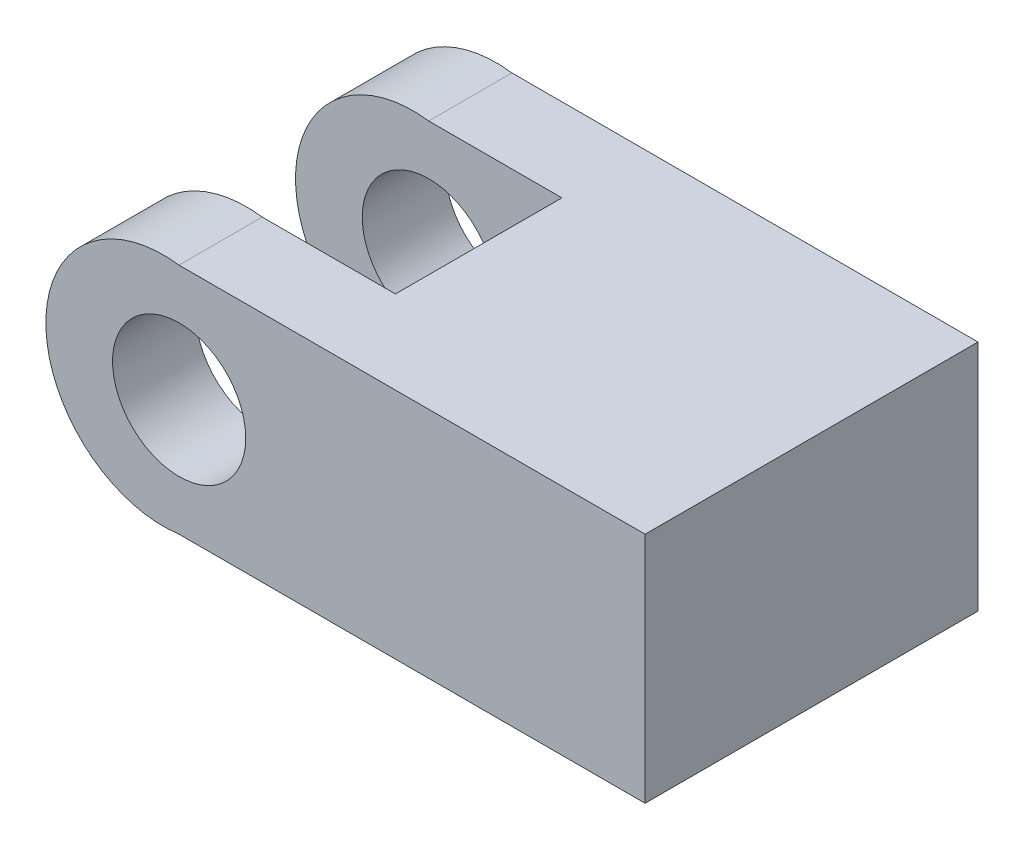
ISO-10303-21;
HEADER;
FILE_DESCRIPTION(('STEP AP214'),'2;1');
FILE_NAME('part.step','',(''),(''),'','','');
FILE_SCHEMA(('AUTOMOTIVE_DESIGN { 1 0 10303 214 1 1 1 1 }'));
ENDSEC;
DATA;
#1=APPLICATION_CONTEXT('core data for automotive mechanical design processes');
#2=APPLICATION_PROTOCOL_DEFINITION('international standard','automotive_design',2000,#1);
#3=PRODUCT_CONTEXT('',#1,'mechanical');
#4=PRODUCT('Part','Part','',(#3));
#5=PRODUCT_RELATED_PRODUCT_CATEGORY('part','',(#4));
#6=PRODUCT_DEFINITION_FORMATION('','',#4);
#7=PRODUCT_DEFINITION_CONTEXT('part definition',#1,'design');
#8=PRODUCT_DEFINITION('design','',#6,#7);
#9=PRODUCT_DEFINITION_SHAPE('','',#8);
#10=(LENGTH_UNIT() NAMED_UNIT(*) SI_UNIT(.MILLI.,.METRE.));
#11=(NAMED_UNIT(*) PLANE_ANGLE_UNIT() SI_UNIT($,.RADIAN.));
#12=(NAMED_UNIT(*) SI_UNIT($,.STERADIAN.) SOLID_ANGLE_UNIT());
#13=UNCERTAINTY_MEASURE_WITH_UNIT(LENGTH_MEASURE(1.E-05),#10,'distance_accuracy_value','');
#14=(GEOMETRIC_REPRESENTATION_CONTEXT(3) GLOBAL_UNCERTAINTY_ASSIGNED_CONTEXT((#13)) GLOBAL_UNIT_ASSIGNED_CONTEXT((#10,
#11,#12)) REPRESENTATION_CONTEXT('',''));
#15=CARTESIAN_POINT('',(0.,0.,0.));
#16=DIRECTION('',(0.,0.,1.));
#17=DIRECTION('',(1.,0.,0.));
#18=AXIS2_PLACEMENT_3D('',#15,#16,#17);
#19=CARTESIAN_POINT('',(0.,7.,0.));
#20=DIRECTION('',(0.,-1.,0.));
#21=DIRECTION('',(0.,0.,-1.));
#22=AXIS2_PLACEMENT_3D('',#19,#20,#21);
#23=PLANE('',#22);
#24=DIRECTION('',(-1.,0.,0.));
#25=VECTOR('',#24,1.);
#26=CARTESIAN_POINT('',(0.,7.,-7.5));
#27=LINE('',#26,#25);
#28=CARTESIAN_POINT('',(0.,7.,-7.5));
#29=VERTEX_POINT('',#28);
#30=CARTESIAN_POINT('',(-4.,7.,-7.5));
#31=VERTEX_POINT('',#30);
#32=EDGE_CURVE('E122',#29,#31,#27,.T.);
#33=ORIENTED_EDGE('',*,*,#32,.F.);
#34=DIRECTION('',(0.,0.,-1.));
#35=VECTOR('',#34,1.);
#36=CARTESIAN_POINT('',(0.,7.,0.));
#37=LINE('',#36,#35);
#38=CARTESIAN_POINT('',(0.,7.,-2.5));
#39=VERTEX_POINT('',#38);
#40=EDGE_CURVE('E125',#39,#29,#37,.T.);
#41=ORIENTED_EDGE('',*,*,#40,.F.);
#42=DIRECTION('',(1.,0.,0.));
#43=VECTOR('',#42,1.);
#44=CARTESIAN_POINT('',(0.,7.,-2.5));
#45=LINE('',#44,#43);
#46=CARTESIAN_POINT('',(-4.,7.,-2.5));
#47=VERTEX_POINT('',#46);
#48=EDGE_CURVE('E107',#47,#39,#45,.T.);
#49=ORIENTED_EDGE('',*,*,#48,.F.);
#50=DIRECTION('',(0.,0.,1.));
#51=VECTOR('',#50,1.);
#52=CARTESIAN_POINT('',(-4.,7.,-10.));
#53=LINE('',#52,#51);
#54=CARTESIAN_POINT('',(-4.,7.,0.));
#55=VERTEX_POINT('',#54);
#56=EDGE_CURVE('E137',#47,#55,#53,.T.);
#57=ORIENTED_EDGE('',*,*,#56,.T.);
#58=DIRECTION('',(1.,0.,0.));
#59=VECTOR('',#58,1.);
#60=CARTESIAN_POINT('',(0.,7.,0.));
#61=LINE('',#60,#59);
#62=CARTESIAN_POINT('',(10.,7.,0.));
#63=VERTEX_POINT('',#62);
#64=EDGE_CURVE('E94',#55,#63,#61,.T.);
#65=ORIENTED_EDGE('',*,*,#64,.T.);
#66=DIRECTION('',(0.,0.,-1.));
#67=VECTOR('',#66,1.);
#68=CARTESIAN_POINT('',(10.,7.,0.));
#69=LINE('',#68,#67);
#70=CARTESIAN_POINT('',(10.,7.,-10.));
#71=VERTEX_POINT('',#70);
#72=EDGE_CURVE('E57',#63,#71,#69,.T.);
#73=ORIENTED_EDGE('',*,*,#72,.T.);
#74=DIRECTION('',(-1.,0.,0.));
#75=VECTOR('',#74,1.);
#76=CARTESIAN_POINT('',(0.,7.,-10.));
#77=LINE('',#76,#75);
#78=CARTESIAN_POINT('',(-4.,7.,-10.));
#79=VERTEX_POINT('',#78);
#80=EDGE_CURVE('E87',#71,#79,#77,.T.);
#81=ORIENTED_EDGE('',*,*,#80,.T.);
#82=EDGE_CURVE('E142',#79,#31,#53,.T.);
#83=ORIENTED_EDGE('',*,*,#82,.T.);
#84=EDGE_LOOP('',(#33,#41,#49,#57,#65,#73,#81,#83));
#85=FACE_BOUND('',#84,.T.);
#86=ADVANCED_FACE('F33',(#85),#23,.F.);
#87=CARTESIAN_POINT('',(0.,0.,0.));
#88=DIRECTION('',(0.,-1.,0.));
#89=DIRECTION('',(0.,0.,-1.));
#90=AXIS2_PLACEMENT_3D('',#87,#88,#89);
#91=PLANE('',#90);
#92=DIRECTION('',(0.,0.,-1.));
#93=VECTOR('',#92,1.);
#94=CARTESIAN_POINT('',(0.,0.,0.));
#95=LINE('',#94,#93);
#96=CARTESIAN_POINT('',(0.,0.,-2.5));
#97=VERTEX_POINT('',#96);
#98=CARTESIAN_POINT('',(0.,0.,-7.5));
#99=VERTEX_POINT('',#98);
#100=EDGE_CURVE('E11',#97,#99,#95,.T.);
#101=ORIENTED_EDGE('',*,*,#100,.T.);
#102=DIRECTION('',(-1.,0.,0.));
#103=VECTOR('',#102,1.);
#104=CARTESIAN_POINT('',(0.,0.,-7.5));
#105=LINE('',#104,#103);
#106=CARTESIAN_POINT('',(-4.,0.,-7.5));
#107=VERTEX_POINT('',#106);
#108=EDGE_CURVE('E111',#99,#107,#105,.T.);
#109=ORIENTED_EDGE('',*,*,#108,.T.);
#110=DIRECTION('',(0.,0.,1.));
#111=VECTOR('',#110,1.);
#112=CARTESIAN_POINT('',(-4.,0.,-10.));
#113=LINE('',#112,#111);
#114=CARTESIAN_POINT('',(-4.,0.,-10.));
#115=VERTEX_POINT('',#114);
#116=EDGE_CURVE('E92',#115,#107,#113,.T.);
#117=ORIENTED_EDGE('',*,*,#116,.F.);
#118=DIRECTION('',(-1.,0.,0.));
#119=VECTOR('',#118,1.);
#120=CARTESIAN_POINT('',(0.,0.,-10.));
#121=LINE('',#120,#119);
#122=CARTESIAN_POINT('',(10.,0.,-10.));
#123=VERTEX_POINT('',#122);
#124=EDGE_CURVE('E79',#123,#115,#121,.T.);
#125=ORIENTED_EDGE('',*,*,#124,.F.);
#126=DIRECTION('',(0.,0.,-1.));
#127=VECTOR('',#126,1.);
#128=CARTESIAN_POINT('',(10.,0.,0.));
#129=LINE('',#128,#127);
#130=CARTESIAN_POINT('',(10.,0.,0.));
#131=VERTEX_POINT('',#130);
#132=EDGE_CURVE('E70',#131,#123,#129,.T.);
#133=ORIENTED_EDGE('',*,*,#132,.F.);
#134=DIRECTION('',(1.,0.,0.));
#135=VECTOR('',#134,1.);
#136=CARTESIAN_POINT('',(0.,0.,0.));
#137=LINE('',#136,#135);
#138=CARTESIAN_POINT('',(-4.,0.,0.));
#139=VERTEX_POINT('',#138);
#140=EDGE_CURVE('E80',#139,#131,#137,.T.);
#141=ORIENTED_EDGE('',*,*,#140,.F.);
#142=CARTESIAN_POINT('',(-4.,0.,-2.5));
#143=VERTEX_POINT('',#142);
#144=EDGE_CURVE('E141',#143,#139,#113,.T.);
#145=ORIENTED_EDGE('',*,*,#144,.F.);
#146=DIRECTION('',(1.,0.,0.));
#147=VECTOR('',#146,1.);
#148=CARTESIAN_POINT('',(0.,0.,-2.5));
#149=LINE('',#148,#147);
#150=EDGE_CURVE('E48',#143,#97,#149,.T.);
#151=ORIENTED_EDGE('',*,*,#150,.T.);
#152=EDGE_LOOP('',(#101,#109,#117,#125,#133,#141,#145,#151));
#153=FACE_BOUND('',#152,.T.);
#154=ADVANCED_FACE('F89',(#153),#91,.T.);
#155=CARTESIAN_POINT('',(-4.46875,3.5,-10.));
#156=DIRECTION('',(0.,0.,1.));
#157=DIRECTION('',(1.,0.,0.));
#158=AXIS2_PLACEMENT_3D('',#155,#156,#157);
#159=CYLINDRICAL_SURFACE('',#158,3.53125);
#160=ORIENTED_EDGE('',*,*,#116,.T.);
#161=CARTESIAN_POINT('',(-4.46875,3.5,-7.5));
#162=DIRECTION('',(0.,0.,1.));
#163=DIRECTION('',(1.,0.,0.));
#164=AXIS2_PLACEMENT_3D('',#161,#162,#163);
#165=CIRCLE('',#164,3.53125);
#166=EDGE_CURVE('E106',#107,#31,#165,.F.);
#167=ORIENTED_EDGE('',*,*,#166,.T.);
#168=ORIENTED_EDGE('',*,*,#82,.F.);
#169=CARTESIAN_POINT('',(-4.46875,3.5,-10.));
#170=DIRECTION('',(0.,0.,1.));
#171=DIRECTION('',(-1.,0.,0.));
#172=AXIS2_PLACEMENT_3D('',#169,#170,#171);
#173=CIRCLE('',#172,3.53125);
#174=EDGE_CURVE('E135',#79,#115,#173,.T.);
#175=ORIENTED_EDGE('',*,*,#174,.T.);
#176=EDGE_LOOP('',(#160,#167,#168,#175));
#177=FACE_BOUND('',#176,.T.);
#178=ADVANCED_FACE('F190',(#177),#159,.T.);
#179=ORIENTED_EDGE('',*,*,#56,.F.);
#180=CARTESIAN_POINT('',(-4.46875,3.5,-2.5));
#181=DIRECTION('',(0.,0.,-1.));
#182=DIRECTION('',(-1.,0.,0.));
#183=AXIS2_PLACEMENT_3D('',#180,#181,#182);
#184=CIRCLE('',#183,3.53125);
#185=EDGE_CURVE('E102',#47,#143,#184,.F.);
#186=ORIENTED_EDGE('',*,*,#185,.T.);
#187=ORIENTED_EDGE('',*,*,#144,.T.);
#188=CARTESIAN_POINT('',(-4.46875,3.5,0.));
#189=DIRECTION('',(0.,0.,1.));
#190=DIRECTION('',(-1.,0.,0.));
#191=AXIS2_PLACEMENT_3D('',#188,#189,#190);
#192=CIRCLE('',#191,3.53125);
#193=EDGE_CURVE('E132',#55,#139,#192,.T.);
#194=ORIENTED_EDGE('',*,*,#193,.F.);
#195=EDGE_LOOP('',(#179,#186,#187,#194));
#196=FACE_BOUND('',#195,.T.);
#197=ADVANCED_FACE('F185',(#196),#159,.T.);
#198=CARTESIAN_POINT('',(-3.9963175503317,3.5,-10.));
#199=DIRECTION('',(0.,0.,1.));
#200=DIRECTION('',(1.,0.,0.));
#201=AXIS2_PLACEMENT_3D('',#198,#199,#200);
#202=CYLINDRICAL_SURFACE('',#201,2.);
#203=CARTESIAN_POINT('',(-3.9963175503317,3.5,-10.));
#204=DIRECTION('',(0.,0.,1.));
#205=DIRECTION('',(1.,0.,0.));
#206=AXIS2_PLACEMENT_3D('',#203,#204,#205);
#207=CIRCLE('',#206,2.);
#208=CARTESIAN_POINT('',(-1.9963175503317,3.5,-10.));
#209=VERTEX_POINT('',#208);
#210=EDGE_CURVE('E129',#209,#209,#207,.T.);
#211=ORIENTED_EDGE('',*,*,#210,.F.);
#212=EDGE_LOOP('',(#211));
#213=FACE_BOUND('',#212,.T.);
#214=CARTESIAN_POINT('',(-3.9963175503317,3.5,-7.5));
#215=DIRECTION('',(0.,0.,1.));
#216=DIRECTION('',(1.,0.,0.));
#217=AXIS2_PLACEMENT_3D('',#214,#215,#216);
#218=CIRCLE('',#217,2.);
#219=CARTESIAN_POINT('',(-1.9963175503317,3.5,-7.5));
#220=VERTEX_POINT('',#219);
#221=EDGE_CURVE('E104',#220,#220,#218,.F.);
#222=ORIENTED_EDGE('',*,*,#221,.F.);
#223=EDGE_LOOP('',(#222));
#224=FACE_BOUND('',#223,.T.);
#225=ADVANCED_FACE('F198',(#213,#224),#202,.F.);
#226=CARTESIAN_POINT('',(-3.9963175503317,3.5,0.));
#227=DIRECTION('',(0.,0.,1.));
#228=DIRECTION('',(1.,0.,0.));
#229=AXIS2_PLACEMENT_3D('',#226,#227,#228);
#230=CIRCLE('',#229,2.);
#231=CARTESIAN_POINT('',(-1.9963175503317,3.5,0.));
#232=VERTEX_POINT('',#231);
#233=EDGE_CURVE('E128',#232,#232,#230,.T.);
#234=ORIENTED_EDGE('',*,*,#233,.T.);
#235=EDGE_LOOP('',(#234));
#236=FACE_BOUND('',#235,.T.);
#237=CARTESIAN_POINT('',(-3.9963175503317,3.5,-2.5));
#238=DIRECTION('',(0.,0.,-1.));
#239=DIRECTION('',(-1.,0.,0.));
#240=AXIS2_PLACEMENT_3D('',#237,#238,#239);
#241=CIRCLE('',#240,2.);
#242=CARTESIAN_POINT('',(-5.9963175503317,3.5,-2.5));
#243=VERTEX_POINT('',#242);
#244=EDGE_CURVE('E100',#243,#243,#241,.F.);
#245=ORIENTED_EDGE('',*,*,#244,.F.);
#246=EDGE_LOOP('',(#245));
#247=FACE_BOUND('',#246,.T.);
#248=ADVANCED_FACE('F212',(#236,#247),#202,.F.);
#249=CARTESIAN_POINT('',(0.,7.,0.));
#250=DIRECTION('',(0.,0.,-1.));
#251=DIRECTION('',(-1.,0.,0.));
#252=AXIS2_PLACEMENT_3D('',#249,#250,#251);
#253=PLANE('',#252);
#254=ORIENTED_EDGE('',*,*,#233,.F.);
#255=EDGE_LOOP('',(#254));
#256=FACE_BOUND('',#255,.T.);
#257=ORIENTED_EDGE('',*,*,#140,.T.);
#258=DIRECTION('',(0.,-1.,0.));
#259=VECTOR('',#258,1.);
#260=CARTESIAN_POINT('',(10.,7.,0.));
#261=LINE('',#260,#259);
#262=EDGE_CURVE('E41',#63,#131,#261,.T.);
#263=ORIENTED_EDGE('',*,*,#262,.F.);
#264=ORIENTED_EDGE('',*,*,#64,.F.);
#265=ORIENTED_EDGE('',*,*,#193,.T.);
#266=EDGE_LOOP('',(#257,#263,#264,#265));
#267=FACE_BOUND('',#266,.T.);
#268=ADVANCED_FACE('F35',(#256,#267),#253,.F.);
#269=CARTESIAN_POINT('',(10.,7.,0.));
#270=DIRECTION('',(-1.,0.,0.));
#271=DIRECTION('',(0.,0.,1.));
#272=AXIS2_PLACEMENT_3D('',#269,#270,#271);
#273=PLANE('',#272);
#274=ORIENTED_EDGE('',*,*,#132,.T.);
#275=DIRECTION('',(0.,-1.,0.));
#276=VECTOR('',#275,1.);
#277=CARTESIAN_POINT('',(10.,7.,-10.));
#278=LINE('',#277,#276);
#279=EDGE_CURVE('E73',#71,#123,#278,.T.);
#280=ORIENTED_EDGE('',*,*,#279,.F.);
#281=ORIENTED_EDGE('',*,*,#72,.F.);
#282=ORIENTED_EDGE('',*,*,#262,.T.);
#283=EDGE_LOOP('',(#274,#280,#281,#282));
#284=FACE_BOUND('',#283,.T.);
#285=ADVANCED_FACE('F72',(#284),#273,.F.);
#286=CARTESIAN_POINT('',(0.,7.,-10.));
#287=DIRECTION('',(0.,0.,1.));
#288=DIRECTION('',(1.,0.,0.));
#289=AXIS2_PLACEMENT_3D('',#286,#287,#288);
#290=PLANE('',#289);
#291=ORIENTED_EDGE('',*,*,#210,.T.);
#292=EDGE_LOOP('',(#291));
#293=FACE_BOUND('',#292,.T.);
#294=ORIENTED_EDGE('',*,*,#124,.T.);
#295=ORIENTED_EDGE('',*,*,#174,.F.);
#296=ORIENTED_EDGE('',*,*,#80,.F.);
#297=ORIENTED_EDGE('',*,*,#279,.T.);
#298=EDGE_LOOP('',(#294,#295,#296,#297));
#299=FACE_BOUND('',#298,.T.);
#300=ADVANCED_FACE('F84',(#293,#299),#290,.F.);
#301=CARTESIAN_POINT('',(0.,17.,-2.5));
#302=DIRECTION('',(-1.,0.,0.));
#303=DIRECTION('',(0.,0.,1.));
#304=AXIS2_PLACEMENT_3D('',#301,#302,#303);
#305=PLANE('',#304);
#306=ORIENTED_EDGE('',*,*,#40,.T.);
#307=DIRECTION('',(0.,-1.,0.));
#308=VECTOR('',#307,1.);
#309=CARTESIAN_POINT('',(0.,17.,-7.5));
#310=LINE('',#309,#308);
#311=EDGE_CURVE('E103',#29,#99,#310,.T.);
#312=ORIENTED_EDGE('',*,*,#311,.T.);
#313=ORIENTED_EDGE('',*,*,#100,.F.);
#314=DIRECTION('',(0.,-1.,0.));
#315=VECTOR('',#314,1.);
#316=CARTESIAN_POINT('',(0.,17.,-2.5));
#317=LINE('',#316,#315);
#318=EDGE_CURVE('E178',#39,#97,#317,.T.);
#319=ORIENTED_EDGE('',*,*,#318,.F.);
#320=EDGE_LOOP('',(#306,#312,#313,#319));
#321=FACE_BOUND('',#320,.T.);
#322=ADVANCED_FACE('F177',(#321),#305,.T.);
#323=CARTESIAN_POINT('',(0.,17.,-7.5));
#324=DIRECTION('',(0.,0.,1.));
#325=DIRECTION('',(1.,0.,0.));
#326=AXIS2_PLACEMENT_3D('',#323,#324,#325);
#327=PLANE('',#326);
#328=ORIENTED_EDGE('',*,*,#221,.T.);
#329=EDGE_LOOP('',(#328));
#330=FACE_BOUND('',#329,.T.);
#331=ORIENTED_EDGE('',*,*,#32,.T.);
#332=ORIENTED_EDGE('',*,*,#166,.F.);
#333=ORIENTED_EDGE('',*,*,#108,.F.);
#334=ORIENTED_EDGE('',*,*,#311,.F.);
#335=EDGE_LOOP('',(#331,#332,#333,#334));
#336=FACE_BOUND('',#335,.T.);
#337=ADVANCED_FACE('F188',(#330,#336),#327,.T.);
#338=CARTESIAN_POINT('',(0.,17.,-2.5));
#339=DIRECTION('',(0.,0.,-1.));
#340=DIRECTION('',(-1.,0.,0.));
#341=AXIS2_PLACEMENT_3D('',#338,#339,#340);
#342=PLANE('',#341);
#343=ORIENTED_EDGE('',*,*,#244,.T.);
#344=EDGE_LOOP('',(#343));
#345=FACE_BOUND('',#344,.T.);
#346=ORIENTED_EDGE('',*,*,#48,.T.);
#347=ORIENTED_EDGE('',*,*,#318,.T.);
#348=ORIENTED_EDGE('',*,*,#150,.F.);
#349=ORIENTED_EDGE('',*,*,#185,.F.);
#350=EDGE_LOOP('',(#346,#347,#348,#349));
#351=FACE_BOUND('',#350,.T.);
#352=ADVANCED_FACE('F181',(#345,#351),#342,.T.);
#353=CLOSED_SHELL('',(#86,#154,#178,#197,#225,#248,#268,#285,#300,#322,#337,#352));
#354=MANIFOLD_SOLID_BREP('B2',#353);
#355=ADVANCED_BREP_SHAPE_REPRESENTATION('',(#18,#354),#14);
#356=SHAPE_DEFINITION_REPRESENTATION(#9,#355);
ENDSEC;
END-ISO-10303-21;
